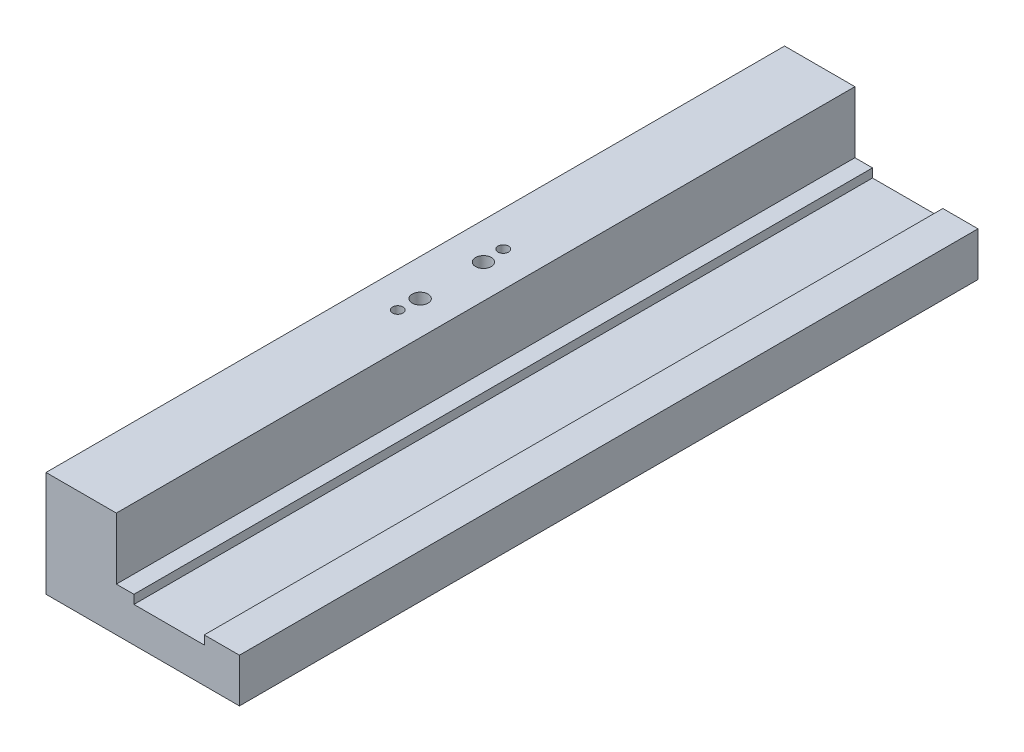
from build123d import *

# Parameters (mm, degrees)
AUFSATZ_LINEAR_AUSTRAGEN1_DEPTH = 420
F_6_0_6_DURCHMESSER_BOHRUNG1_D  = 6
BOHRUNG1_D                      = 9
BOHRUNG1_DEPTH                  = 60
BOHRUNG1_CBORE_D                = 15
BOHRUNG1_CBORE_DEPTH            = 9
BOHRUNG1_TIP                    = 2.703872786


with BuildPart() as part:
    # Skizze1 → Aufsatz-Linear austragen1 (new body)
    with BuildSketch(Plane.XY):
        Polygon((0, 0), (110, 0), (110, 25), (90, 25), (90, 20), (50, 20), (50, 25), (40, 25), (40, 60), (0, 60), align=None)
    extrude(amount=AUFSATZ_LINEAR_AUSTRAGEN1_DEPTH)

    # 6.0 _6_ Durchmesser Bohrung1 (through all)
    with Locations(Plane(origin=(0, 60, 0), x_dir=(1, 0, 0), z_dir=(0, 1, 0))):
        with Locations((20, -180), (20, -240)):
            Hole(F_6_0_6_DURCHMESSER_BOHRUNG1_D / 2)

    # Bohrung1
    with Locations(Plane(origin=(0, 0, 0), x_dir=(-1, 0, 0), z_dir=(0, -1, 0))):
        with Locations((-20.765953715, -228), (-20.765953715, -192)):
            CounterBoreHole(BOHRUNG1_D / 2, BOHRUNG1_CBORE_D / 2, BOHRUNG1_CBORE_DEPTH, depth=BOHRUNG1_DEPTH)
            with Locations((0, 0, -(BOHRUNG1_DEPTH + BOHRUNG1_TIP / 2))):  # 118° drill point
                Cone(0, BOHRUNG1_D / 2, BOHRUNG1_TIP, mode=Mode.SUBTRACT)


solid = part.part
